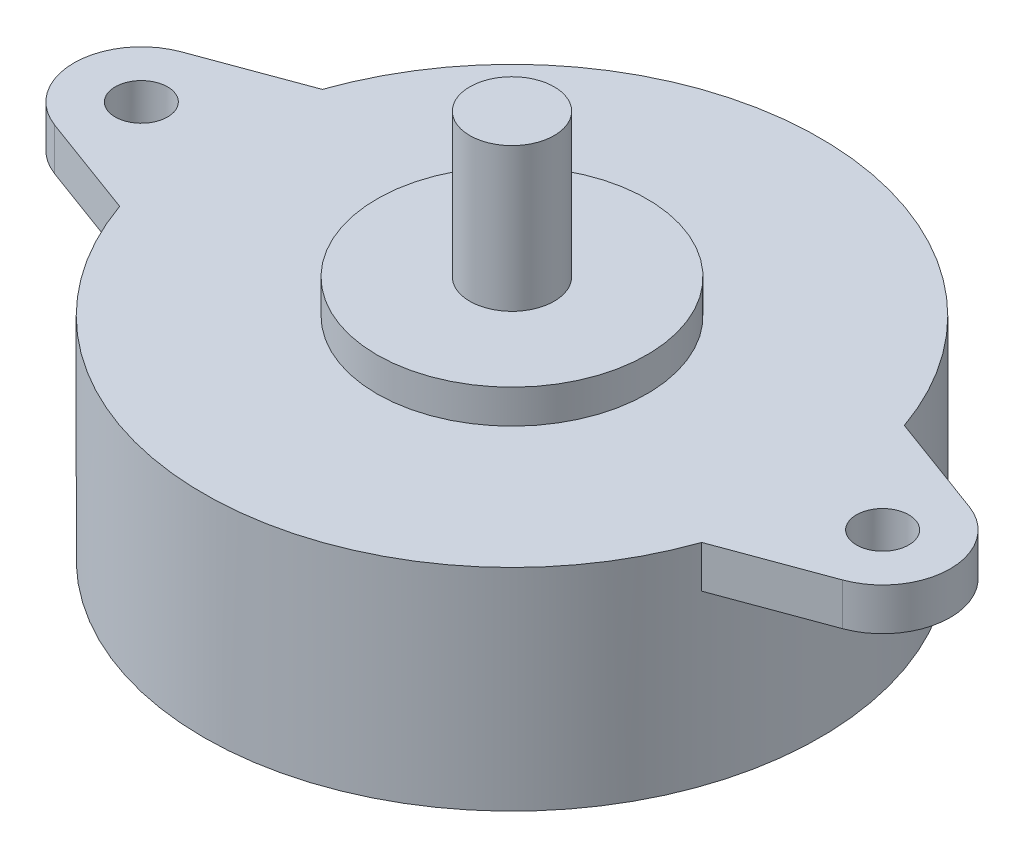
from build123d import *

# Parameters (mm, degrees)
ESTRUSIONE_ESTRUSIONE1_DEPTH = 12.5
SCHIZZO2_R                   = 8
ESTRUSIONE_ESTRUSIONE2_DEPTH = 2
SCHIZZO3_R                   = 2.5
ESTRUSIONE_ESTRUSIONE3_DEPTH = 8.5
SCHIZZO4_R                   = 27.230254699
SCHIZZO4_R_2                 = 18.25
TAGLIO_ESTRUSIONE1_DEPTH     = 10
SCHIZZO5_R                   = 1.55
TAGLIO_ESTRUSIONE2_DEPTH     = 10


with BuildPart() as part:
    # Schizzo1 → Estrusione-Estrusione1 (new body)
    with BuildSketch(Plane(origin=(0, 0, 0), x_dir=(1, 0, 0), z_dir=(0, 1, 0))):
        with BuildLine():
            Line((-17.235501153, 6), (-23.332954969, 3.753323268))
            ThreePointArc((-23.332954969, 3.753323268), (-25.95, 0), (-23.332954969, -3.753323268))
            Line((-23.332954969, -3.753323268), (-17.235501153, -6))
            ThreePointArc((-17.235501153, -6), (0, -18.25), (17.235501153, -6))
            Line((17.235501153, -6), (23.332954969, -3.753323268))
            ThreePointArc((23.332954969, -3.753323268), (25.95, 0), (23.332954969, 3.753323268))
            Line((23.332954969, 3.753323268), (17.235501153, 6))
            ThreePointArc((17.235501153, 6), (0, 18.25), (-17.235501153, 6))
        make_face()
    extrude(amount=ESTRUSIONE_ESTRUSIONE1_DEPTH)

    # Schizzo2 → Estrusione-Estrusione2 (add)
    with BuildSketch(Plane(origin=(0, 12.5, 0), x_dir=(1, 0, 0), z_dir=(0, 1, 0))):
        with Locations(Location((0, 0, 0), (0, 0, 270))):
            Circle(SCHIZZO2_R)
    extrude(amount=ESTRUSIONE_ESTRUSIONE2_DEPTH)

    # Schizzo3 → Estrusione-Estrusione3 (add)
    with BuildSketch(Plane(origin=(0, 14.5, 0), x_dir=(1, 0, 0), z_dir=(0, 1, 0))):
        with Locations(Location((0, 0, 0), (0, 0, 270))):
            Circle(SCHIZZO3_R)
    extrude(amount=ESTRUSIONE_ESTRUSIONE3_DEPTH)

    # Schizzo4 → Taglio-Estrusione1 (cut)
    with BuildSketch(Plane.XZ):
        Circle(SCHIZZO4_R)
        with Locations(Location((0, 0, 0), (0, 0, 340.806038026))):
            Circle(SCHIZZO4_R_2, mode=Mode.SUBTRACT)
    extrude(amount=-TAGLIO_ESTRUSIONE1_DEPTH, mode=Mode.SUBTRACT)

    # Schizzo5 → Taglio-Estrusione2 (cut)
    with BuildSketch(Plane(origin=(0, 12.5, 0), x_dir=(1, 0, 0), z_dir=(0, 1, 0))):
        with Locations(Location((-21.95, 0, 0), (0, 0, 270))):
            Circle(SCHIZZO5_R)
        with Locations(Location((21.95, 0, 0), (0, 0, 270))):
            Circle(SCHIZZO5_R)
    extrude(amount=-TAGLIO_ESTRUSIONE2_DEPTH, mode=Mode.SUBTRACT)


solid = part.part
